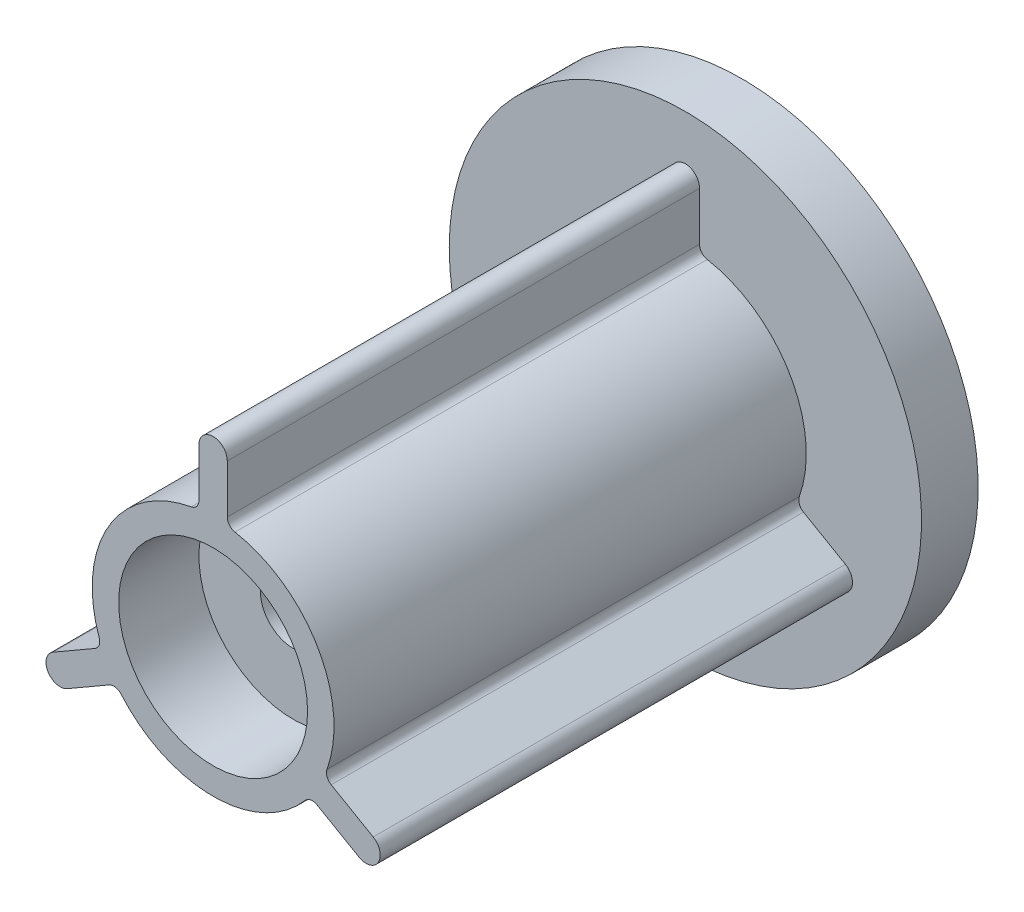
ISO-10303-21;
HEADER;
FILE_DESCRIPTION(('STEP AP214'),'2;1');
FILE_NAME('part.step','',(''),(''),'','','');
FILE_SCHEMA(('AUTOMOTIVE_DESIGN { 1 0 10303 214 1 1 1 1 }'));
ENDSEC;
DATA;
#1=APPLICATION_CONTEXT('core data for automotive mechanical design processes');
#2=APPLICATION_PROTOCOL_DEFINITION('international standard','automotive_design',2000,#1);
#3=PRODUCT_CONTEXT('',#1,'mechanical');
#4=PRODUCT('Part','Part','',(#3));
#5=PRODUCT_RELATED_PRODUCT_CATEGORY('part','',(#4));
#6=PRODUCT_DEFINITION_FORMATION('','',#4);
#7=PRODUCT_DEFINITION_CONTEXT('part definition',#1,'design');
#8=PRODUCT_DEFINITION('design','',#6,#7);
#9=PRODUCT_DEFINITION_SHAPE('','',#8);
#10=(LENGTH_UNIT() NAMED_UNIT(*) SI_UNIT(.MILLI.,.METRE.));
#11=(NAMED_UNIT(*) PLANE_ANGLE_UNIT() SI_UNIT($,.RADIAN.));
#12=(NAMED_UNIT(*) SI_UNIT($,.STERADIAN.) SOLID_ANGLE_UNIT());
#13=UNCERTAINTY_MEASURE_WITH_UNIT(LENGTH_MEASURE(1.E-05),#10,'distance_accuracy_value','');
#14=(GEOMETRIC_REPRESENTATION_CONTEXT(3) GLOBAL_UNCERTAINTY_ASSIGNED_CONTEXT((#13)) GLOBAL_UNIT_ASSIGNED_CONTEXT((#10,
#11,#12)) REPRESENTATION_CONTEXT('',''));
#15=CARTESIAN_POINT('',(0.,0.,0.));
#16=DIRECTION('',(0.,0.,1.));
#17=DIRECTION('',(1.,0.,0.));
#18=AXIS2_PLACEMENT_3D('',#15,#16,#17);
#19=CARTESIAN_POINT('',(0.,0.,-14.));
#20=DIRECTION('',(0.,0.,1.));
#21=DIRECTION('',(1.,0.,0.));
#22=AXIS2_PLACEMENT_3D('',#19,#20,#21);
#23=CYLINDRICAL_SURFACE('',#22,1.75);
#24=CARTESIAN_POINT('',(0.,0.,9.75));
#25=DIRECTION('',(0.,0.,1.));
#26=DIRECTION('',(1.,0.,0.));
#27=AXIS2_PLACEMENT_3D('',#24,#25,#26);
#28=CIRCLE('',#27,1.75);
#29=CARTESIAN_POINT('',(1.75,0.,9.75));
#30=VERTEX_POINT('',#29);
#31=EDGE_CURVE('E196',#30,#30,#28,.F.);
#32=ORIENTED_EDGE('',*,*,#31,.F.);
#33=EDGE_LOOP('',(#32));
#34=FACE_BOUND('',#33,.T.);
#35=CARTESIAN_POINT('',(0.,0.,-9.75));
#36=DIRECTION('',(0.,0.,-1.));
#37=DIRECTION('',(-1.,0.,0.));
#38=AXIS2_PLACEMENT_3D('',#35,#36,#37);
#39=CIRCLE('',#38,1.75);
#40=CARTESIAN_POINT('',(-1.75,0.,-9.75));
#41=VERTEX_POINT('',#40);
#42=EDGE_CURVE('E201',#41,#41,#39,.F.);
#43=ORIENTED_EDGE('',*,*,#42,.F.);
#44=EDGE_LOOP('',(#43));
#45=FACE_BOUND('',#44,.T.);
#46=ADVANCED_FACE('F33',(#34,#45),#23,.F.);
#47=CARTESIAN_POINT('',(0.,0.,-14.));
#48=DIRECTION('',(0.,0.,1.));
#49=DIRECTION('',(1.,0.,0.));
#50=AXIS2_PLACEMENT_3D('',#47,#48,#49);
#51=PLANE('',#50);
#52=CARTESIAN_POINT('',(0.,0.,-14.));
#53=DIRECTION('',(0.,0.,-1.));
#54=DIRECTION('',(-1.,0.,0.));
#55=AXIS2_PLACEMENT_3D('',#52,#53,#54);
#56=CIRCLE('',#55,12.5);
#57=CARTESIAN_POINT('',(-12.5,0.,-14.));
#58=VERTEX_POINT('',#57);
#59=EDGE_CURVE('E199',#58,#58,#56,.T.);
#60=ORIENTED_EDGE('',*,*,#59,.T.);
#61=EDGE_LOOP('',(#60));
#62=FACE_BOUND('',#61,.T.);
#63=CARTESIAN_POINT('',(0.,0.,-14.));
#64=DIRECTION('',(0.,0.,1.));
#65=DIRECTION('',(1.,0.,0.));
#66=AXIS2_PLACEMENT_3D('',#63,#64,#65);
#67=CIRCLE('',#66,5.);
#68=CARTESIAN_POINT('',(5.,0.,-14.));
#69=VERTEX_POINT('',#68);
#70=EDGE_CURVE('E611',#69,#69,#67,.T.);
#71=ORIENTED_EDGE('',*,*,#70,.T.);
#72=EDGE_LOOP('',(#71));
#73=FACE_BOUND('',#72,.T.);
#74=ADVANCED_FACE('F364',(#62,#73),#51,.F.);
#75=CARTESIAN_POINT('',(-0.75,9.35,14.));
#76=DIRECTION('',(1.,0.,0.));
#77=DIRECTION('',(0.,0.,-1.));
#78=AXIS2_PLACEMENT_3D('',#75,#76,#77);
#79=PLANE('',#78);
#80=DIRECTION('',(0.,1.,0.));
#81=VECTOR('',#80,1.);
#82=CARTESIAN_POINT('',(-0.75,9.35,-11.));
#83=LINE('',#82,#81);
#84=CARTESIAN_POINT('',(-0.75,6.78583082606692,-11.));
#85=VERTEX_POINT('',#84);
#86=CARTESIAN_POINT('',(-0.75,9.35,-11.));
#87=VERTEX_POINT('',#86);
#88=EDGE_CURVE('E184',#85,#87,#83,.T.);
#89=ORIENTED_EDGE('',*,*,#88,.F.);
#90=DIRECTION('',(0.,0.,1.));
#91=VECTOR('',#90,1.);
#92=CARTESIAN_POINT('',(-0.75,6.78583082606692,14.));
#93=LINE('',#92,#91);
#94=CARTESIAN_POINT('',(-0.75,6.78583082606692,14.));
#95=VERTEX_POINT('',#94);
#96=EDGE_CURVE('E48',#85,#95,#93,.T.);
#97=ORIENTED_EDGE('',*,*,#96,.T.);
#98=DIRECTION('',(0.,-1.,0.));
#99=VECTOR('',#98,1.);
#100=CARTESIAN_POINT('',(-0.75,9.35,14.));
#101=LINE('',#100,#99);
#102=CARTESIAN_POINT('',(-0.75,9.35,14.));
#103=VERTEX_POINT('',#102);
#104=EDGE_CURVE('E295',#103,#95,#101,.T.);
#105=ORIENTED_EDGE('',*,*,#104,.F.);
#106=DIRECTION('',(0.,0.,-1.));
#107=VECTOR('',#106,1.);
#108=CARTESIAN_POINT('',(-0.75,9.35,14.));
#109=LINE('',#108,#107);
#110=EDGE_CURVE('E180',#103,#87,#109,.T.);
#111=ORIENTED_EDGE('',*,*,#110,.T.);
#112=EDGE_LOOP('',(#89,#97,#105,#111));
#113=FACE_BOUND('',#112,.T.);
#114=ADVANCED_FACE('F370',(#113),#79,.F.);
#115=CARTESIAN_POINT('',(0.,0.,14.));
#116=DIRECTION('',(0.,0.,-1.));
#117=DIRECTION('',(-1.,0.,0.));
#118=AXIS2_PLACEMENT_3D('',#115,#116,#117);
#119=CYLINDRICAL_SURFACE('',#118,6.4);
#120=CARTESIAN_POINT('',(0.,0.,-11.));
#121=DIRECTION('',(0.,0.,-1.));
#122=DIRECTION('',(-1.,0.,0.));
#123=AXIS2_PLACEMENT_3D('',#120,#121,#122);
#124=CIRCLE('',#123,6.4);
#125=CARTESIAN_POINT('',(-6.03056406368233,-2.14296455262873,-11.));
#126=VERTEX_POINT('',#125);
#127=CARTESIAN_POINT('',(-1.15942028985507,6.29410395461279,-11.));
#128=VERTEX_POINT('',#127);
#129=EDGE_CURVE('E291',#126,#128,#124,.T.);
#130=ORIENTED_EDGE('',*,*,#129,.F.);
#131=DIRECTION('',(0.,0.,-1.));
#132=VECTOR('',#131,1.);
#133=CARTESIAN_POINT('',(-6.03056406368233,-2.14296455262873,14.));
#134=LINE('',#133,#132);
#135=CARTESIAN_POINT('',(-6.03056406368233,-2.14296455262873,14.));
#136=VERTEX_POINT('',#135);
#137=EDGE_CURVE('E220',#126,#136,#134,.F.);
#138=ORIENTED_EDGE('',*,*,#137,.T.);
#139=CARTESIAN_POINT('',(0.,0.,14.));
#140=DIRECTION('',(0.,0.,1.));
#141=DIRECTION('',(1.,0.,0.));
#142=AXIS2_PLACEMENT_3D('',#139,#140,#141);
#143=CIRCLE('',#142,6.4);
#144=CARTESIAN_POINT('',(-1.15942028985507,6.29410395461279,14.));
#145=VERTEX_POINT('',#144);
#146=EDGE_CURVE('E297',#145,#136,#143,.T.);
#147=ORIENTED_EDGE('',*,*,#146,.F.);
#148=DIRECTION('',(0.,0.,-1.));
#149=VECTOR('',#148,1.);
#150=CARTESIAN_POINT('',(-1.15942028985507,6.29410395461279,14.));
#151=LINE('',#150,#149);
#152=EDGE_CURVE('E217',#145,#128,#151,.T.);
#153=ORIENTED_EDGE('',*,*,#152,.T.);
#154=EDGE_LOOP('',(#130,#138,#147,#153));
#155=FACE_BOUND('',#154,.T.);
#156=ADVANCED_FACE('F521',(#155),#119,.T.);
#157=CARTESIAN_POINT('',(-8.47233752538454,-4.02548094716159,14.));
#158=DIRECTION('',(-0.499999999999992,0.866025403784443,0.));
#159=DIRECTION('',(-0.866025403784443,-0.499999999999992,0.));
#160=AXIS2_PLACEMENT_3D('',#157,#158,#159);
#161=PLANE('',#160);
#162=DIRECTION('',(0.866025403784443,0.499999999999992,0.));
#163=VECTOR('',#162,1.);
#164=CARTESIAN_POINT('',(-8.47233752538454,-4.02548094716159,14.));
#165=LINE('',#164,#163);
#166=CARTESIAN_POINT('',(-8.47233752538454,-4.02548094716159,14.));
#167=VERTEX_POINT('',#166);
#168=CARTESIAN_POINT('',(-6.25170188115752,-2.74339636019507,14.));
#169=VERTEX_POINT('',#168);
#170=EDGE_CURVE('E300',#167,#169,#165,.T.);
#171=ORIENTED_EDGE('',*,*,#170,.T.);
#172=DIRECTION('',(0.,0.,-1.));
#173=VECTOR('',#172,1.);
#174=CARTESIAN_POINT('',(-6.25170188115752,-2.74339636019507,14.));
#175=LINE('',#174,#173);
#176=CARTESIAN_POINT('',(-6.25170188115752,-2.74339636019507,-11.));
#177=VERTEX_POINT('',#176);
#178=EDGE_CURVE('E185',#169,#177,#175,.T.);
#179=ORIENTED_EDGE('',*,*,#178,.T.);
#180=DIRECTION('',(-0.866025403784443,-0.499999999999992,0.));
#181=VECTOR('',#180,1.);
#182=CARTESIAN_POINT('',(-8.47233752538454,-4.02548094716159,-11.));
#183=LINE('',#182,#181);
#184=CARTESIAN_POINT('',(-8.47233752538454,-4.02548094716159,-11.));
#185=VERTEX_POINT('',#184);
#186=EDGE_CURVE('E289',#177,#185,#183,.T.);
#187=ORIENTED_EDGE('',*,*,#186,.T.);
#188=DIRECTION('',(0.,0.,-1.));
#189=VECTOR('',#188,1.);
#190=CARTESIAN_POINT('',(-8.47233752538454,-4.02548094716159,14.));
#191=LINE('',#190,#189);
#192=EDGE_CURVE('E186',#167,#185,#191,.T.);
#193=ORIENTED_EDGE('',*,*,#192,.F.);
#194=EDGE_LOOP('',(#171,#179,#187,#193));
#195=FACE_BOUND('',#194,.T.);
#196=ADVANCED_FACE('F528',(#195),#161,.T.);
#197=CARTESIAN_POINT('',(-8.09733752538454,-4.67499999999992,14.));
#198=DIRECTION('',(0.,0.,-1.));
#199=DIRECTION('',(-1.,0.,0.));
#200=AXIS2_PLACEMENT_3D('',#197,#198,#199);
#201=CYLINDRICAL_SURFACE('',#200,0.75);
#202=CARTESIAN_POINT('',(-8.09733752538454,-4.67499999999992,-11.));
#203=DIRECTION('',(0.,0.,-1.));
#204=DIRECTION('',(-1.,0.,0.));
#205=AXIS2_PLACEMENT_3D('',#202,#203,#204);
#206=CIRCLE('',#205,0.75);
#207=CARTESIAN_POINT('',(-7.72233752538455,-5.32451905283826,-11.));
#208=VERTEX_POINT('',#207);
#209=EDGE_CURVE('E286',#208,#185,#206,.T.);
#210=ORIENTED_EDGE('',*,*,#209,.F.);
#211=DIRECTION('',(0.,0.,-1.));
#212=VECTOR('',#211,1.);
#213=CARTESIAN_POINT('',(-7.72233752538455,-5.32451905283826,14.));
#214=LINE('',#213,#212);
#215=CARTESIAN_POINT('',(-7.72233752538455,-5.32451905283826,14.));
#216=VERTEX_POINT('',#215);
#217=EDGE_CURVE('E192',#216,#208,#214,.T.);
#218=ORIENTED_EDGE('',*,*,#217,.F.);
#219=CARTESIAN_POINT('',(-8.09733752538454,-4.67499999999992,14.));
#220=DIRECTION('',(0.,0.,1.));
#221=DIRECTION('',(1.,0.,0.));
#222=AXIS2_PLACEMENT_3D('',#219,#220,#221);
#223=CIRCLE('',#222,0.75);
#224=EDGE_CURVE('E303',#167,#216,#223,.T.);
#225=ORIENTED_EDGE('',*,*,#224,.F.);
#226=ORIENTED_EDGE('',*,*,#192,.T.);
#227=EDGE_LOOP('',(#210,#218,#225,#226));
#228=FACE_BOUND('',#227,.T.);
#229=ADVANCED_FACE('F333',(#228),#201,.T.);
#230=CARTESIAN_POINT('',(-7.72233752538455,-5.32451905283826,14.));
#231=DIRECTION('',(-0.499999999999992,0.866025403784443,0.));
#232=DIRECTION('',(-0.866025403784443,-0.499999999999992,0.));
#233=AXIS2_PLACEMENT_3D('',#230,#231,#232);
#234=PLANE('',#233);
#235=DIRECTION('',(-0.866025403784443,-0.499999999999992,0.));
#236=VECTOR('',#235,1.);
#237=CARTESIAN_POINT('',(-7.72233752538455,-5.32451905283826,-11.));
#238=LINE('',#237,#236);
#239=CARTESIAN_POINT('',(-5.50170188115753,-4.04243446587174,-11.));
#240=VERTEX_POINT('',#239);
#241=EDGE_CURVE('E284',#240,#208,#238,.T.);
#242=ORIENTED_EDGE('',*,*,#241,.F.);
#243=DIRECTION('',(0.,0.,1.));
#244=VECTOR('',#243,1.);
#245=CARTESIAN_POINT('',(-5.50170188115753,-4.04243446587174,14.));
#246=LINE('',#245,#244);
#247=CARTESIAN_POINT('',(-5.50170188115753,-4.04243446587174,14.));
#248=VERTEX_POINT('',#247);
#249=EDGE_CURVE('E227',#240,#248,#246,.T.);
#250=ORIENTED_EDGE('',*,*,#249,.T.);
#251=DIRECTION('',(0.866025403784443,0.499999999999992,0.));
#252=VECTOR('',#251,1.);
#253=CARTESIAN_POINT('',(-7.72233752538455,-5.32451905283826,14.));
#254=LINE('',#253,#252);
#255=EDGE_CURVE('E305',#216,#248,#254,.T.);
#256=ORIENTED_EDGE('',*,*,#255,.F.);
#257=ORIENTED_EDGE('',*,*,#217,.T.);
#258=EDGE_LOOP('',(#242,#250,#256,#257));
#259=FACE_BOUND('',#258,.T.);
#260=ADVANCED_FACE('F328',(#259),#234,.F.);
#261=CARTESIAN_POINT('',(0.,0.,14.));
#262=DIRECTION('',(0.,0.,-1.));
#263=DIRECTION('',(-1.,0.,0.));
#264=AXIS2_PLACEMENT_3D('',#261,#262,#263);
#265=CYLINDRICAL_SURFACE('',#264,6.4);
#266=CARTESIAN_POINT('',(0.,0.,14.));
#267=DIRECTION('',(0.,0.,1.));
#268=DIRECTION('',(1.,0.,0.));
#269=AXIS2_PLACEMENT_3D('',#266,#267,#268);
#270=CIRCLE('',#269,6.4);
#271=CARTESIAN_POINT('',(-4.87114377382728,-4.15113940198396,14.));
#272=VERTEX_POINT('',#271);
#273=CARTESIAN_POINT('',(4.87114377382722,-4.15113940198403,14.));
#274=VERTEX_POINT('',#273);
#275=EDGE_CURVE('E308',#272,#274,#270,.T.);
#276=ORIENTED_EDGE('',*,*,#275,.F.);
#277=DIRECTION('',(0.,0.,-1.));
#278=VECTOR('',#277,1.);
#279=CARTESIAN_POINT('',(-4.87114377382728,-4.15113940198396,14.));
#280=LINE('',#279,#278);
#281=CARTESIAN_POINT('',(-4.87114377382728,-4.15113940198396,-11.));
#282=VERTEX_POINT('',#281);
#283=EDGE_CURVE('E224',#272,#282,#280,.T.);
#284=ORIENTED_EDGE('',*,*,#283,.T.);
#285=CARTESIAN_POINT('',(0.,0.,-11.));
#286=DIRECTION('',(0.,0.,-1.));
#287=DIRECTION('',(-1.,0.,0.));
#288=AXIS2_PLACEMENT_3D('',#285,#286,#287);
#289=CIRCLE('',#288,6.4);
#290=CARTESIAN_POINT('',(4.87114377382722,-4.15113940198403,-11.));
#291=VERTEX_POINT('',#290);
#292=EDGE_CURVE('E281',#291,#282,#289,.T.);
#293=ORIENTED_EDGE('',*,*,#292,.F.);
#294=DIRECTION('',(0.,0.,-1.));
#295=VECTOR('',#294,1.);
#296=CARTESIAN_POINT('',(4.87114377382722,-4.15113940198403,14.));
#297=LINE('',#296,#295);
#298=EDGE_CURVE('E222',#291,#274,#297,.F.);
#299=ORIENTED_EDGE('',*,*,#298,.T.);
#300=EDGE_LOOP('',(#276,#284,#293,#299));
#301=FACE_BOUND('',#300,.T.);
#302=ADVANCED_FACE('F342',(#301),#265,.T.);
#303=CARTESIAN_POINT('',(7.72233752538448,-5.32451905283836,14.));
#304=DIRECTION('',(-0.500000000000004,-0.866025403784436,0.));
#305=DIRECTION('',(0.866025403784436,-0.500000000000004,0.));
#306=AXIS2_PLACEMENT_3D('',#303,#304,#305);
#307=PLANE('',#306);
#308=DIRECTION('',(-0.866025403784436,0.500000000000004,0.));
#309=VECTOR('',#308,1.);
#310=CARTESIAN_POINT('',(7.72233752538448,-5.32451905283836,14.));
#311=LINE('',#310,#309);
#312=CARTESIAN_POINT('',(7.72233752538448,-5.32451905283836,14.));
#313=VERTEX_POINT('',#312);
#314=CARTESIAN_POINT('',(5.50170188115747,-4.04243446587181,14.));
#315=VERTEX_POINT('',#314);
#316=EDGE_CURVE('E311',#313,#315,#311,.T.);
#317=ORIENTED_EDGE('',*,*,#316,.T.);
#318=DIRECTION('',(0.,0.,-1.));
#319=VECTOR('',#318,1.);
#320=CARTESIAN_POINT('',(5.50170188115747,-4.04243446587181,14.));
#321=LINE('',#320,#319);
#322=CARTESIAN_POINT('',(5.50170188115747,-4.04243446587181,-11.));
#323=VERTEX_POINT('',#322);
#324=EDGE_CURVE('E229',#315,#323,#321,.T.);
#325=ORIENTED_EDGE('',*,*,#324,.T.);
#326=DIRECTION('',(0.866025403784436,-0.500000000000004,0.));
#327=VECTOR('',#326,1.);
#328=CARTESIAN_POINT('',(7.72233752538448,-5.32451905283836,-11.));
#329=LINE('',#328,#327);
#330=CARTESIAN_POINT('',(7.72233752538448,-5.32451905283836,-11.));
#331=VERTEX_POINT('',#330);
#332=EDGE_CURVE('E276',#323,#331,#329,.T.);
#333=ORIENTED_EDGE('',*,*,#332,.T.);
#334=DIRECTION('',(0.,0.,-1.));
#335=VECTOR('',#334,1.);
#336=CARTESIAN_POINT('',(7.72233752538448,-5.32451905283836,14.));
#337=LINE('',#336,#335);
#338=EDGE_CURVE('E321',#313,#331,#337,.T.);
#339=ORIENTED_EDGE('',*,*,#338,.F.);
#340=EDGE_LOOP('',(#317,#325,#333,#339));
#341=FACE_BOUND('',#340,.T.);
#342=ADVANCED_FACE('F351',(#341),#307,.T.);
#343=CARTESIAN_POINT('',(8.09733752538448,-4.67500000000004,14.));
#344=DIRECTION('',(0.,0.,-1.));
#345=DIRECTION('',(-1.,0.,0.));
#346=AXIS2_PLACEMENT_3D('',#343,#344,#345);
#347=CYLINDRICAL_SURFACE('',#346,0.750000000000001);
#348=CARTESIAN_POINT('',(8.09733752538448,-4.67500000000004,-11.));
#349=DIRECTION('',(0.,0.,-1.));
#350=DIRECTION('',(-1.,0.,0.));
#351=AXIS2_PLACEMENT_3D('',#348,#349,#350);
#352=CIRCLE('',#351,0.750000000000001);
#353=CARTESIAN_POINT('',(8.47233752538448,-4.02548094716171,-11.));
#354=VERTEX_POINT('',#353);
#355=EDGE_CURVE('E274',#354,#331,#352,.T.);
#356=ORIENTED_EDGE('',*,*,#355,.F.);
#357=DIRECTION('',(0.,0.,-1.));
#358=VECTOR('',#357,1.);
#359=CARTESIAN_POINT('',(8.47233752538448,-4.02548094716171,14.));
#360=LINE('',#359,#358);
#361=CARTESIAN_POINT('',(8.47233752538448,-4.02548094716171,14.));
#362=VERTEX_POINT('',#361);
#363=EDGE_CURVE('E179',#362,#354,#360,.T.);
#364=ORIENTED_EDGE('',*,*,#363,.F.);
#365=CARTESIAN_POINT('',(8.09733752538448,-4.67500000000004,14.));
#366=DIRECTION('',(0.,0.,1.));
#367=DIRECTION('',(1.,0.,0.));
#368=AXIS2_PLACEMENT_3D('',#365,#366,#367);
#369=CIRCLE('',#368,0.750000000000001);
#370=EDGE_CURVE('E314',#313,#362,#369,.T.);
#371=ORIENTED_EDGE('',*,*,#370,.F.);
#372=ORIENTED_EDGE('',*,*,#338,.T.);
#373=EDGE_LOOP('',(#356,#364,#371,#372));
#374=FACE_BOUND('',#373,.T.);
#375=ADVANCED_FACE('F353',(#374),#347,.T.);
#376=CARTESIAN_POINT('',(8.47233752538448,-4.02548094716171,14.));
#377=DIRECTION('',(-0.500000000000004,-0.866025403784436,0.));
#378=DIRECTION('',(0.866025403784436,-0.500000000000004,0.));
#379=AXIS2_PLACEMENT_3D('',#376,#377,#378);
#380=PLANE('',#379);
#381=DIRECTION('',(0.866025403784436,-0.500000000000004,0.));
#382=VECTOR('',#381,1.);
#383=CARTESIAN_POINT('',(8.47233752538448,-4.02548094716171,-11.));
#384=LINE('',#383,#382);
#385=CARTESIAN_POINT('',(6.25170188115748,-2.74339636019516,-11.));
#386=VERTEX_POINT('',#385);
#387=EDGE_CURVE('E268',#386,#354,#384,.T.);
#388=ORIENTED_EDGE('',*,*,#387,.F.);
#389=DIRECTION('',(0.,0.,1.));
#390=VECTOR('',#389,1.);
#391=CARTESIAN_POINT('',(6.25170188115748,-2.74339636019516,14.));
#392=LINE('',#391,#390);
#393=CARTESIAN_POINT('',(6.25170188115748,-2.74339636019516,14.));
#394=VERTEX_POINT('',#393);
#395=EDGE_CURVE('E237',#386,#394,#392,.T.);
#396=ORIENTED_EDGE('',*,*,#395,.T.);
#397=DIRECTION('',(-0.866025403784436,0.500000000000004,0.));
#398=VECTOR('',#397,1.);
#399=CARTESIAN_POINT('',(8.47233752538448,-4.02548094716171,14.));
#400=LINE('',#399,#398);
#401=EDGE_CURVE('E254',#362,#394,#400,.T.);
#402=ORIENTED_EDGE('',*,*,#401,.F.);
#403=ORIENTED_EDGE('',*,*,#363,.T.);
#404=EDGE_LOOP('',(#388,#396,#402,#403));
#405=FACE_BOUND('',#404,.T.);
#406=ADVANCED_FACE('F272',(#405),#380,.F.);
#407=CARTESIAN_POINT('',(0.,0.,14.));
#408=DIRECTION('',(0.,0.,-1.));
#409=DIRECTION('',(-1.,0.,0.));
#410=AXIS2_PLACEMENT_3D('',#407,#408,#409);
#411=CYLINDRICAL_SURFACE('',#410,6.4);
#412=CARTESIAN_POINT('',(0.,0.,14.));
#413=DIRECTION('',(0.,0.,1.));
#414=DIRECTION('',(1.,0.,0.));
#415=AXIS2_PLACEMENT_3D('',#412,#413,#414);
#416=CIRCLE('',#415,6.4);
#417=CARTESIAN_POINT('',(6.0305640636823,-2.14296455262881,14.));
#418=VERTEX_POINT('',#417);
#419=CARTESIAN_POINT('',(1.15942028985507,6.29410395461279,14.));
#420=VERTEX_POINT('',#419);
#421=EDGE_CURVE('E252',#418,#420,#416,.T.);
#422=ORIENTED_EDGE('',*,*,#421,.F.);
#423=DIRECTION('',(0.,0.,-1.));
#424=VECTOR('',#423,1.);
#425=CARTESIAN_POINT('',(6.0305640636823,-2.14296455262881,14.));
#426=LINE('',#425,#424);
#427=CARTESIAN_POINT('',(6.0305640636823,-2.14296455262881,-11.));
#428=VERTEX_POINT('',#427);
#429=EDGE_CURVE('E234',#418,#428,#426,.T.);
#430=ORIENTED_EDGE('',*,*,#429,.T.);
#431=CARTESIAN_POINT('',(0.,0.,-11.));
#432=DIRECTION('',(0.,0.,-1.));
#433=DIRECTION('',(-1.,0.,0.));
#434=AXIS2_PLACEMENT_3D('',#431,#432,#433);
#435=CIRCLE('',#434,6.4);
#436=CARTESIAN_POINT('',(1.15942028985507,6.29410395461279,-11.));
#437=VERTEX_POINT('',#436);
#438=EDGE_CURVE('E169',#437,#428,#435,.T.);
#439=ORIENTED_EDGE('',*,*,#438,.F.);
#440=DIRECTION('',(0.,0.,-1.));
#441=VECTOR('',#440,1.);
#442=CARTESIAN_POINT('',(1.15942028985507,6.29410395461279,14.));
#443=LINE('',#442,#441);
#444=EDGE_CURVE('E232',#437,#420,#443,.F.);
#445=ORIENTED_EDGE('',*,*,#444,.T.);
#446=EDGE_LOOP('',(#422,#430,#439,#445));
#447=FACE_BOUND('',#446,.T.);
#448=ADVANCED_FACE('F259',(#447),#411,.T.);
#449=CARTESIAN_POINT('',(0.75,9.35,14.));
#450=DIRECTION('',(1.,0.,0.));
#451=DIRECTION('',(0.,0.,-1.));
#452=AXIS2_PLACEMENT_3D('',#449,#450,#451);
#453=PLANE('',#452);
#454=DIRECTION('',(0.,-1.,0.));
#455=VECTOR('',#454,1.);
#456=CARTESIAN_POINT('',(0.75,9.35,14.));
#457=LINE('',#456,#455);
#458=CARTESIAN_POINT('',(0.75,9.35,14.));
#459=VERTEX_POINT('',#458);
#460=CARTESIAN_POINT('',(0.75,6.78583082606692,14.));
#461=VERTEX_POINT('',#460);
#462=EDGE_CURVE('E263',#459,#461,#457,.T.);
#463=ORIENTED_EDGE('',*,*,#462,.T.);
#464=DIRECTION('',(0.,0.,-1.));
#465=VECTOR('',#464,1.);
#466=CARTESIAN_POINT('',(0.75,6.78583082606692,14.));
#467=LINE('',#466,#465);
#468=CARTESIAN_POINT('',(0.75,6.78583082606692,-11.));
#469=VERTEX_POINT('',#468);
#470=EDGE_CURVE('E166',#461,#469,#467,.T.);
#471=ORIENTED_EDGE('',*,*,#470,.T.);
#472=DIRECTION('',(0.,1.,0.));
#473=VECTOR('',#472,1.);
#474=CARTESIAN_POINT('',(0.75,9.35,-11.));
#475=LINE('',#474,#473);
#476=CARTESIAN_POINT('',(0.75,9.35,-11.));
#477=VERTEX_POINT('',#476);
#478=EDGE_CURVE('E160',#469,#477,#475,.T.);
#479=ORIENTED_EDGE('',*,*,#478,.T.);
#480=DIRECTION('',(0.,0.,-1.));
#481=VECTOR('',#480,1.);
#482=CARTESIAN_POINT('',(0.75,9.35,14.));
#483=LINE('',#482,#481);
#484=EDGE_CURVE('E163',#459,#477,#483,.T.);
#485=ORIENTED_EDGE('',*,*,#484,.F.);
#486=EDGE_LOOP('',(#463,#471,#479,#485));
#487=FACE_BOUND('',#486,.T.);
#488=ADVANCED_FACE('F162',(#487),#453,.T.);
#489=CARTESIAN_POINT('',(0.,9.35,14.));
#490=DIRECTION('',(0.,0.,-1.));
#491=DIRECTION('',(-1.,0.,0.));
#492=AXIS2_PLACEMENT_3D('',#489,#490,#491);
#493=CYLINDRICAL_SURFACE('',#492,0.75);
#494=CARTESIAN_POINT('',(0.,9.35,-11.));
#495=DIRECTION('',(0.,0.,-1.));
#496=DIRECTION('',(-1.,0.,0.));
#497=AXIS2_PLACEMENT_3D('',#494,#495,#496);
#498=CIRCLE('',#497,0.75);
#499=EDGE_CURVE('E176',#87,#477,#498,.T.);
#500=ORIENTED_EDGE('',*,*,#499,.F.);
#501=ORIENTED_EDGE('',*,*,#110,.F.);
#502=CARTESIAN_POINT('',(0.,9.35,14.));
#503=DIRECTION('',(0.,0.,1.));
#504=DIRECTION('',(1.,0.,0.));
#505=AXIS2_PLACEMENT_3D('',#502,#503,#504);
#506=CIRCLE('',#505,0.75);
#507=EDGE_CURVE('E178',#459,#103,#506,.T.);
#508=ORIENTED_EDGE('',*,*,#507,.F.);
#509=ORIENTED_EDGE('',*,*,#484,.T.);
#510=EDGE_LOOP('',(#500,#501,#508,#509));
#511=FACE_BOUND('',#510,.T.);
#512=ADVANCED_FACE('F174',(#511),#493,.T.);
#513=CARTESIAN_POINT('',(0.,0.,14.));
#514=DIRECTION('',(0.,0.,1.));
#515=DIRECTION('',(1.,0.,0.));
#516=AXIS2_PLACEMENT_3D('',#513,#514,#515);
#517=PLANE('',#516);
#518=CARTESIAN_POINT('',(0.,0.,14.));
#519=DIRECTION('',(0.,0.,1.));
#520=DIRECTION('',(1.,0.,0.));
#521=AXIS2_PLACEMENT_3D('',#518,#519,#520);
#522=CIRCLE('',#521,5.);
#523=CARTESIAN_POINT('',(5.,0.,14.));
#524=VERTEX_POINT('',#523);
#525=EDGE_CURVE('E203',#524,#524,#522,.T.);
#526=ORIENTED_EDGE('',*,*,#525,.F.);
#527=EDGE_LOOP('',(#526));
#528=FACE_BOUND('',#527,.T.);
#529=ORIENTED_EDGE('',*,*,#104,.T.);
#530=CARTESIAN_POINT('',(-1.25,6.78583082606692,14.));
#531=DIRECTION('',(0.,0.,1.));
#532=DIRECTION('',(1.,0.,0.));
#533=AXIS2_PLACEMENT_3D('',#530,#531,#532);
#534=CIRCLE('',#533,0.5);
#535=EDGE_CURVE('E11',#95,#145,#534,.F.);
#536=ORIENTED_EDGE('',*,*,#535,.T.);
#537=ORIENTED_EDGE('',*,*,#146,.T.);
#538=CARTESIAN_POINT('',(-6.50170188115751,-2.31038365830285,14.));
#539=DIRECTION('',(0.,0.,1.));
#540=DIRECTION('',(1.,0.,0.));
#541=AXIS2_PLACEMENT_3D('',#538,#539,#540);
#542=CIRCLE('',#541,0.5);
#543=EDGE_CURVE('E241',#136,#169,#542,.F.);
#544=ORIENTED_EDGE('',*,*,#543,.T.);
#545=ORIENTED_EDGE('',*,*,#170,.F.);
#546=ORIENTED_EDGE('',*,*,#224,.T.);
#547=ORIENTED_EDGE('',*,*,#255,.T.);
#548=CARTESIAN_POINT('',(-5.25170188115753,-4.47544716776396,14.));
#549=DIRECTION('',(0.,0.,1.));
#550=DIRECTION('',(1.,0.,0.));
#551=AXIS2_PLACEMENT_3D('',#548,#549,#550);
#552=CIRCLE('',#551,0.5);
#553=EDGE_CURVE('E243',#248,#272,#552,.F.);
#554=ORIENTED_EDGE('',*,*,#553,.T.);
#555=ORIENTED_EDGE('',*,*,#275,.T.);
#556=CARTESIAN_POINT('',(5.25170188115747,-4.47544716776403,14.));
#557=DIRECTION('',(0.,0.,1.));
#558=DIRECTION('',(1.,0.,0.));
#559=AXIS2_PLACEMENT_3D('',#556,#557,#558);
#560=CIRCLE('',#559,0.5);
#561=EDGE_CURVE('E245',#274,#315,#560,.F.);
#562=ORIENTED_EDGE('',*,*,#561,.T.);
#563=ORIENTED_EDGE('',*,*,#316,.F.);
#564=ORIENTED_EDGE('',*,*,#370,.T.);
#565=ORIENTED_EDGE('',*,*,#401,.T.);
#566=CARTESIAN_POINT('',(6.50170188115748,-2.31038365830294,14.));
#567=DIRECTION('',(0.,0.,1.));
#568=DIRECTION('',(1.,0.,0.));
#569=AXIS2_PLACEMENT_3D('',#566,#567,#568);
#570=CIRCLE('',#569,0.5);
#571=EDGE_CURVE('E247',#394,#418,#570,.F.);
#572=ORIENTED_EDGE('',*,*,#571,.T.);
#573=ORIENTED_EDGE('',*,*,#421,.T.);
#574=CARTESIAN_POINT('',(1.25,6.78583082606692,14.));
#575=DIRECTION('',(0.,0.,1.));
#576=DIRECTION('',(1.,0.,0.));
#577=AXIS2_PLACEMENT_3D('',#574,#575,#576);
#578=CIRCLE('',#577,0.5);
#579=EDGE_CURVE('E41',#420,#461,#578,.F.);
#580=ORIENTED_EDGE('',*,*,#579,.T.);
#581=ORIENTED_EDGE('',*,*,#462,.F.);
#582=ORIENTED_EDGE('',*,*,#507,.T.);
#583=EDGE_LOOP('',(#529,#536,#537,#544,#545,#546,#547,#554,#555,#562,#563,#564,#565,#572,#573,
#580,#581,#582));
#584=FACE_BOUND('',#583,.T.);
#585=ADVANCED_FACE('F251',(#528,#584),#517,.T.);
#586=CARTESIAN_POINT('',(0.,0.,-11.));
#587=DIRECTION('',(0.,0.,-1.));
#588=DIRECTION('',(-1.,0.,0.));
#589=AXIS2_PLACEMENT_3D('',#586,#587,#588);
#590=PLANE('',#589);
#591=CARTESIAN_POINT('',(0.,0.,-11.));
#592=DIRECTION('',(0.,0.,-1.));
#593=DIRECTION('',(-1.,0.,0.));
#594=AXIS2_PLACEMENT_3D('',#591,#592,#593);
#595=CIRCLE('',#594,12.5);
#596=CARTESIAN_POINT('',(-12.5,0.,-11.));
#597=VERTEX_POINT('',#596);
#598=EDGE_CURVE('E170',#597,#597,#595,.T.);
#599=ORIENTED_EDGE('',*,*,#598,.F.);
#600=EDGE_LOOP('',(#599));
#601=FACE_BOUND('',#600,.T.);
#602=ORIENTED_EDGE('',*,*,#186,.F.);
#603=CARTESIAN_POINT('',(-6.50170188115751,-2.31038365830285,-11.));
#604=DIRECTION('',(0.,0.,-1.));
#605=DIRECTION('',(-1.,0.,0.));
#606=AXIS2_PLACEMENT_3D('',#603,#604,#605);
#607=CIRCLE('',#606,0.5);
#608=EDGE_CURVE('E215',#177,#126,#607,.F.);
#609=ORIENTED_EDGE('',*,*,#608,.T.);
#610=ORIENTED_EDGE('',*,*,#129,.T.);
#611=CARTESIAN_POINT('',(-1.25,6.78583082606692,-11.));
#612=DIRECTION('',(0.,0.,-1.));
#613=DIRECTION('',(-1.,0.,0.));
#614=AXIS2_PLACEMENT_3D('',#611,#612,#613);
#615=CIRCLE('',#614,0.5);
#616=EDGE_CURVE('E189',#128,#85,#615,.F.);
#617=ORIENTED_EDGE('',*,*,#616,.T.);
#618=ORIENTED_EDGE('',*,*,#88,.T.);
#619=ORIENTED_EDGE('',*,*,#499,.T.);
#620=ORIENTED_EDGE('',*,*,#478,.F.);
#621=CARTESIAN_POINT('',(1.25,6.78583082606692,-11.));
#622=DIRECTION('',(0.,0.,-1.));
#623=DIRECTION('',(-1.,0.,0.));
#624=AXIS2_PLACEMENT_3D('',#621,#622,#623);
#625=CIRCLE('',#624,0.5);
#626=EDGE_CURVE('E207',#469,#437,#625,.F.);
#627=ORIENTED_EDGE('',*,*,#626,.T.);
#628=ORIENTED_EDGE('',*,*,#438,.T.);
#629=CARTESIAN_POINT('',(6.50170188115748,-2.31038365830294,-11.));
#630=DIRECTION('',(0.,0.,-1.));
#631=DIRECTION('',(-1.,0.,0.));
#632=AXIS2_PLACEMENT_3D('',#629,#630,#631);
#633=CIRCLE('',#632,0.5);
#634=EDGE_CURVE('E209',#428,#386,#633,.F.);
#635=ORIENTED_EDGE('',*,*,#634,.T.);
#636=ORIENTED_EDGE('',*,*,#387,.T.);
#637=ORIENTED_EDGE('',*,*,#355,.T.);
#638=ORIENTED_EDGE('',*,*,#332,.F.);
#639=CARTESIAN_POINT('',(5.25170188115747,-4.47544716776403,-11.));
#640=DIRECTION('',(0.,0.,-1.));
#641=DIRECTION('',(-1.,0.,0.));
#642=AXIS2_PLACEMENT_3D('',#639,#640,#641);
#643=CIRCLE('',#642,0.5);
#644=EDGE_CURVE('E211',#323,#291,#643,.F.);
#645=ORIENTED_EDGE('',*,*,#644,.T.);
#646=ORIENTED_EDGE('',*,*,#292,.T.);
#647=CARTESIAN_POINT('',(-5.25170188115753,-4.47544716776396,-11.));
#648=DIRECTION('',(0.,0.,-1.));
#649=DIRECTION('',(-1.,0.,0.));
#650=AXIS2_PLACEMENT_3D('',#647,#648,#649);
#651=CIRCLE('',#650,0.5);
#652=EDGE_CURVE('E213',#282,#240,#651,.F.);
#653=ORIENTED_EDGE('',*,*,#652,.T.);
#654=ORIENTED_EDGE('',*,*,#241,.T.);
#655=ORIENTED_EDGE('',*,*,#209,.T.);
#656=EDGE_LOOP('',(#602,#609,#610,#617,#618,#619,#620,#627,#628,#635,#636,#637,#638,#645,#646,
#653,#654,#655));
#657=FACE_BOUND('',#656,.T.);
#658=ADVANCED_FACE('F183',(#601,#657),#590,.F.);
#659=CARTESIAN_POINT('',(0.,0.,-11.));
#660=DIRECTION('',(0.,0.,-1.));
#661=DIRECTION('',(-1.,0.,0.));
#662=AXIS2_PLACEMENT_3D('',#659,#660,#661);
#663=CYLINDRICAL_SURFACE('',#662,12.5);
#664=ORIENTED_EDGE('',*,*,#598,.T.);
#665=EDGE_LOOP('',(#664));
#666=FACE_BOUND('',#665,.T.);
#667=ORIENTED_EDGE('',*,*,#59,.F.);
#668=EDGE_LOOP('',(#667));
#669=FACE_BOUND('',#668,.T.);
#670=ADVANCED_FACE('F381',(#666,#669),#663,.T.);
#671=CARTESIAN_POINT('',(0.,0.,9.75));
#672=DIRECTION('',(0.,0.,1.));
#673=DIRECTION('',(1.,0.,0.));
#674=AXIS2_PLACEMENT_3D('',#671,#672,#673);
#675=PLANE('',#674);
#676=CARTESIAN_POINT('',(0.,0.,9.75));
#677=DIRECTION('',(0.,0.,1.));
#678=DIRECTION('',(1.,0.,0.));
#679=AXIS2_PLACEMENT_3D('',#676,#677,#678);
#680=CIRCLE('',#679,5.);
#681=CARTESIAN_POINT('',(5.,0.,9.75));
#682=VERTEX_POINT('',#681);
#683=EDGE_CURVE('E200',#682,#682,#680,.T.);
#684=ORIENTED_EDGE('',*,*,#683,.T.);
#685=EDGE_LOOP('',(#684));
#686=FACE_BOUND('',#685,.T.);
#687=ORIENTED_EDGE('',*,*,#31,.T.);
#688=EDGE_LOOP('',(#687));
#689=FACE_BOUND('',#688,.T.);
#690=ADVANCED_FACE('F385',(#686,#689),#675,.T.);
#691=CARTESIAN_POINT('',(0.,0.,9.75));
#692=DIRECTION('',(0.,0.,1.));
#693=DIRECTION('',(1.,0.,0.));
#694=AXIS2_PLACEMENT_3D('',#691,#692,#693);
#695=CYLINDRICAL_SURFACE('',#694,5.);
#696=ORIENTED_EDGE('',*,*,#683,.F.);
#697=EDGE_LOOP('',(#696));
#698=FACE_BOUND('',#697,.T.);
#699=ORIENTED_EDGE('',*,*,#525,.T.);
#700=EDGE_LOOP('',(#699));
#701=FACE_BOUND('',#700,.T.);
#702=ADVANCED_FACE('F377',(#698,#701),#695,.F.);
#703=CARTESIAN_POINT('',(0.,0.,-9.75));
#704=DIRECTION('',(0.,0.,-1.));
#705=DIRECTION('',(1.,0.,0.));
#706=AXIS2_PLACEMENT_3D('',#703,#704,#705);
#707=PLANE('',#706);
#708=CARTESIAN_POINT('',(0.,0.,-9.75));
#709=DIRECTION('',(0.,0.,1.));
#710=DIRECTION('',(1.,0.,0.));
#711=AXIS2_PLACEMENT_3D('',#708,#709,#710);
#712=CIRCLE('',#711,5.);
#713=CARTESIAN_POINT('',(5.,0.,-9.75));
#714=VERTEX_POINT('',#713);
#715=EDGE_CURVE('E204',#714,#714,#712,.T.);
#716=ORIENTED_EDGE('',*,*,#715,.F.);
#717=EDGE_LOOP('',(#716));
#718=FACE_BOUND('',#717,.T.);
#719=ORIENTED_EDGE('',*,*,#42,.T.);
#720=EDGE_LOOP('',(#719));
#721=FACE_BOUND('',#720,.T.);
#722=ADVANCED_FACE('F432',(#718,#721),#707,.T.);
#723=CARTESIAN_POINT('',(0.,0.,-9.75));
#724=DIRECTION('',(0.,0.,-1.));
#725=DIRECTION('',(-1.,0.,0.));
#726=AXIS2_PLACEMENT_3D('',#723,#724,#725);
#727=CYLINDRICAL_SURFACE('',#726,5.);
#728=ORIENTED_EDGE('',*,*,#715,.T.);
#729=EDGE_LOOP('',(#728));
#730=FACE_BOUND('',#729,.T.);
#731=ORIENTED_EDGE('',*,*,#70,.F.);
#732=EDGE_LOOP('',(#731));
#733=FACE_BOUND('',#732,.T.);
#734=ADVANCED_FACE('F439',(#730,#733),#727,.F.);
#735=CARTESIAN_POINT('',(-6.50170188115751,-2.31038365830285,14.));
#736=DIRECTION('',(0.,0.,-1.));
#737=DIRECTION('',(-1.,0.,0.));
#738=AXIS2_PLACEMENT_3D('',#735,#736,#737);
#739=CYLINDRICAL_SURFACE('',#738,0.5);
#740=ORIENTED_EDGE('',*,*,#543,.F.);
#741=ORIENTED_EDGE('',*,*,#137,.F.);
#742=ORIENTED_EDGE('',*,*,#608,.F.);
#743=ORIENTED_EDGE('',*,*,#178,.F.);
#744=EDGE_LOOP('',(#740,#741,#742,#743));
#745=FACE_BOUND('',#744,.T.);
#746=ADVANCED_FACE('F448',(#745),#739,.F.);
#747=CARTESIAN_POINT('',(-5.25170188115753,-4.47544716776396,14.));
#748=DIRECTION('',(0.,0.,-1.));
#749=DIRECTION('',(-1.,0.,0.));
#750=AXIS2_PLACEMENT_3D('',#747,#748,#749);
#751=CYLINDRICAL_SURFACE('',#750,0.5);
#752=ORIENTED_EDGE('',*,*,#553,.F.);
#753=ORIENTED_EDGE('',*,*,#249,.F.);
#754=ORIENTED_EDGE('',*,*,#652,.F.);
#755=ORIENTED_EDGE('',*,*,#283,.F.);
#756=EDGE_LOOP('',(#752,#753,#754,#755));
#757=FACE_BOUND('',#756,.T.);
#758=ADVANCED_FACE('F339',(#757),#751,.F.);
#759=CARTESIAN_POINT('',(5.25170188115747,-4.47544716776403,14.));
#760=DIRECTION('',(0.,0.,-1.));
#761=DIRECTION('',(-1.,0.,0.));
#762=AXIS2_PLACEMENT_3D('',#759,#760,#761);
#763=CYLINDRICAL_SURFACE('',#762,0.5);
#764=ORIENTED_EDGE('',*,*,#561,.F.);
#765=ORIENTED_EDGE('',*,*,#298,.F.);
#766=ORIENTED_EDGE('',*,*,#644,.F.);
#767=ORIENTED_EDGE('',*,*,#324,.F.);
#768=EDGE_LOOP('',(#764,#765,#766,#767));
#769=FACE_BOUND('',#768,.T.);
#770=ADVANCED_FACE('F348',(#769),#763,.F.);
#771=CARTESIAN_POINT('',(6.50170188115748,-2.31038365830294,14.));
#772=DIRECTION('',(0.,0.,-1.));
#773=DIRECTION('',(-1.,0.,0.));
#774=AXIS2_PLACEMENT_3D('',#771,#772,#773);
#775=CYLINDRICAL_SURFACE('',#774,0.5);
#776=ORIENTED_EDGE('',*,*,#571,.F.);
#777=ORIENTED_EDGE('',*,*,#395,.F.);
#778=ORIENTED_EDGE('',*,*,#634,.F.);
#779=ORIENTED_EDGE('',*,*,#429,.F.);
#780=EDGE_LOOP('',(#776,#777,#778,#779));
#781=FACE_BOUND('',#780,.T.);
#782=ADVANCED_FACE('F265',(#781),#775,.F.);
#783=CARTESIAN_POINT('',(1.25,6.78583082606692,14.));
#784=DIRECTION('',(0.,0.,-1.));
#785=DIRECTION('',(-1.,0.,0.));
#786=AXIS2_PLACEMENT_3D('',#783,#784,#785);
#787=CYLINDRICAL_SURFACE('',#786,0.5);
#788=ORIENTED_EDGE('',*,*,#579,.F.);
#789=ORIENTED_EDGE('',*,*,#444,.F.);
#790=ORIENTED_EDGE('',*,*,#626,.F.);
#791=ORIENTED_EDGE('',*,*,#470,.F.);
#792=EDGE_LOOP('',(#788,#789,#790,#791));
#793=FACE_BOUND('',#792,.T.);
#794=ADVANCED_FACE('F475',(#793),#787,.F.);
#795=CARTESIAN_POINT('',(-1.25,6.78583082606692,14.));
#796=DIRECTION('',(0.,0.,-1.));
#797=DIRECTION('',(-1.,0.,0.));
#798=AXIS2_PLACEMENT_3D('',#795,#796,#797);
#799=CYLINDRICAL_SURFACE('',#798,0.5);
#800=ORIENTED_EDGE('',*,*,#535,.F.);
#801=ORIENTED_EDGE('',*,*,#96,.F.);
#802=ORIENTED_EDGE('',*,*,#616,.F.);
#803=ORIENTED_EDGE('',*,*,#152,.F.);
#804=EDGE_LOOP('',(#800,#801,#802,#803));
#805=FACE_BOUND('',#804,.T.);
#806=ADVANCED_FACE('F35',(#805),#799,.F.);
#807=CLOSED_SHELL('',(#46,#74,#114,#156,#196,#229,#260,#302,#342,#375,#406,#448,#488,#512,#585,
#658,#670,#690,#702,#722,#734,#746,#758,#770,#782,#794,#806));
#808=MANIFOLD_SOLID_BREP('B2',#807);
#809=ADVANCED_BREP_SHAPE_REPRESENTATION('',(#18,#808),#14);
#810=SHAPE_DEFINITION_REPRESENTATION(#9,#809);
ENDSEC;
END-ISO-10303-21;
